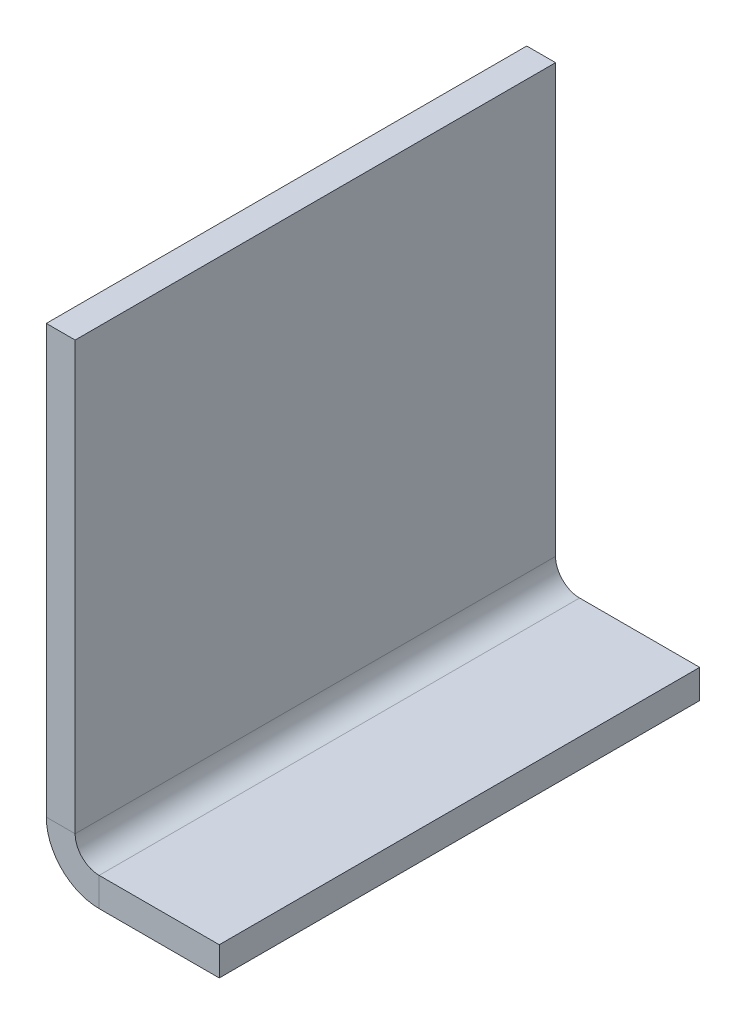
ISO-10303-21;
HEADER;
FILE_DESCRIPTION(('STEP AP214'),'2;1');
FILE_NAME('part.step','',(''),(''),'','','');
FILE_SCHEMA(('AUTOMOTIVE_DESIGN { 1 0 10303 214 1 1 1 1 }'));
ENDSEC;
DATA;
#1=APPLICATION_CONTEXT('core data for automotive mechanical design processes');
#2=APPLICATION_PROTOCOL_DEFINITION('international standard','automotive_design',2000,#1);
#3=PRODUCT_CONTEXT('',#1,'mechanical');
#4=PRODUCT('Part','Part','',(#3));
#5=PRODUCT_RELATED_PRODUCT_CATEGORY('part','',(#4));
#6=PRODUCT_DEFINITION_FORMATION('','',#4);
#7=PRODUCT_DEFINITION_CONTEXT('part definition',#1,'design');
#8=PRODUCT_DEFINITION('design','',#6,#7);
#9=PRODUCT_DEFINITION_SHAPE('','',#8);
#10=(LENGTH_UNIT() NAMED_UNIT(*) SI_UNIT(.MILLI.,.METRE.));
#11=(NAMED_UNIT(*) PLANE_ANGLE_UNIT() SI_UNIT($,.RADIAN.));
#12=(NAMED_UNIT(*) SI_UNIT($,.STERADIAN.) SOLID_ANGLE_UNIT());
#13=UNCERTAINTY_MEASURE_WITH_UNIT(LENGTH_MEASURE(1.E-05),#10,'distance_accuracy_value','');
#14=(GEOMETRIC_REPRESENTATION_CONTEXT(3) GLOBAL_UNCERTAINTY_ASSIGNED_CONTEXT((#13)) GLOBAL_UNIT_ASSIGNED_CONTEXT((#10,
#11,#12)) REPRESENTATION_CONTEXT('',''));
#15=CARTESIAN_POINT('',(0.,0.,0.));
#16=DIRECTION('',(0.,0.,1.));
#17=DIRECTION('',(1.,0.,0.));
#18=AXIS2_PLACEMENT_3D('',#15,#16,#17);
#19=CARTESIAN_POINT('',(0.,11.,50.));
#20=DIRECTION('',(0.,0.,1.));
#21=DIRECTION('',(1.,0.,0.));
#22=AXIS2_PLACEMENT_3D('',#19,#20,#21);
#23=PLANE('',#22);
#24=DIRECTION('',(1.,0.,0.));
#25=VECTOR('',#24,1.);
#26=CARTESIAN_POINT('',(0.,11.,50.));
#27=LINE('',#26,#25);
#28=CARTESIAN_POINT('',(0.,11.,50.));
#29=VERTEX_POINT('',#28);
#30=CARTESIAN_POINT('',(6.,11.,50.));
#31=VERTEX_POINT('',#30);
#32=EDGE_CURVE('E11',#29,#31,#27,.T.);
#33=ORIENTED_EDGE('',*,*,#32,.F.);
#34=CARTESIAN_POINT('',(11.,11.,50.));
#35=DIRECTION('',(0.,0.,1.));
#36=DIRECTION('',(1.,0.,0.));
#37=AXIS2_PLACEMENT_3D('',#34,#35,#36);
#38=CIRCLE('',#37,11.);
#39=CARTESIAN_POINT('',(11.,0.,50.));
#40=VERTEX_POINT('',#39);
#41=EDGE_CURVE('E136',#40,#29,#38,.F.);
#42=ORIENTED_EDGE('',*,*,#41,.F.);
#43=DIRECTION('',(0.,-1.,0.));
#44=VECTOR('',#43,1.);
#45=CARTESIAN_POINT('',(11.,6.,50.));
#46=LINE('',#45,#44);
#47=CARTESIAN_POINT('',(11.,6.,50.));
#48=VERTEX_POINT('',#47);
#49=EDGE_CURVE('E47',#48,#40,#46,.T.);
#50=ORIENTED_EDGE('',*,*,#49,.F.);
#51=CARTESIAN_POINT('',(11.,11.,50.));
#52=DIRECTION('',(0.,0.,1.));
#53=DIRECTION('',(1.,0.,0.));
#54=AXIS2_PLACEMENT_3D('',#51,#52,#53);
#55=CIRCLE('',#54,5.);
#56=EDGE_CURVE('E129',#48,#31,#55,.F.);
#57=ORIENTED_EDGE('',*,*,#56,.T.);
#58=EDGE_LOOP('',(#33,#42,#50,#57));
#59=FACE_BOUND('',#58,.T.);
#60=ADVANCED_FACE('F39',(#59),#23,.T.);
#61=CARTESIAN_POINT('',(11.,6.,50.));
#62=DIRECTION('',(0.,0.,1.));
#63=DIRECTION('',(1.,0.,0.));
#64=AXIS2_PLACEMENT_3D('',#61,#62,#63);
#65=PLANE('',#64);
#66=DIRECTION('',(0.,1.,0.));
#67=VECTOR('',#66,1.);
#68=CARTESIAN_POINT('',(0.,0.,50.));
#69=LINE('',#68,#67);
#70=CARTESIAN_POINT('',(0.,100.,50.));
#71=VERTEX_POINT('',#70);
#72=EDGE_CURVE('E185',#29,#71,#69,.T.);
#73=ORIENTED_EDGE('',*,*,#72,.F.);
#74=ORIENTED_EDGE('',*,*,#32,.T.);
#75=DIRECTION('',(0.,1.,0.));
#76=VECTOR('',#75,1.);
#77=CARTESIAN_POINT('',(6.,0.,50.));
#78=LINE('',#77,#76);
#79=CARTESIAN_POINT('',(6.,100.,50.));
#80=VERTEX_POINT('',#79);
#81=EDGE_CURVE('E95',#31,#80,#78,.T.);
#82=ORIENTED_EDGE('',*,*,#81,.T.);
#83=DIRECTION('',(1.,0.,0.));
#84=VECTOR('',#83,1.);
#85=CARTESIAN_POINT('',(0.,100.,50.));
#86=LINE('',#85,#84);
#87=EDGE_CURVE('E342',#71,#80,#86,.T.);
#88=ORIENTED_EDGE('',*,*,#87,.F.);
#89=EDGE_LOOP('',(#73,#74,#82,#88));
#90=FACE_BOUND('',#89,.T.);
#91=ADVANCED_FACE('F193',(#90),#65,.T.);
#92=CARTESIAN_POINT('',(11.,0.,-50.));
#93=DIRECTION('',(0.,0.,-1.));
#94=DIRECTION('',(-1.,0.,0.));
#95=AXIS2_PLACEMENT_3D('',#92,#93,#94);
#96=PLANE('',#95);
#97=DIRECTION('',(0.,1.,0.));
#98=VECTOR('',#97,1.);
#99=CARTESIAN_POINT('',(11.,0.,-50.));
#100=LINE('',#99,#98);
#101=CARTESIAN_POINT('',(11.,0.,-50.));
#102=VERTEX_POINT('',#101);
#103=CARTESIAN_POINT('',(11.,6.,-50.));
#104=VERTEX_POINT('',#103);
#105=EDGE_CURVE('E82',#102,#104,#100,.T.);
#106=ORIENTED_EDGE('',*,*,#105,.F.);
#107=CARTESIAN_POINT('',(11.,11.,-50.));
#108=DIRECTION('',(0.,0.,1.));
#109=DIRECTION('',(1.,0.,0.));
#110=AXIS2_PLACEMENT_3D('',#107,#108,#109);
#111=CIRCLE('',#110,11.);
#112=CARTESIAN_POINT('',(0.,11.,-50.));
#113=VERTEX_POINT('',#112);
#114=EDGE_CURVE('E151',#102,#113,#111,.F.);
#115=ORIENTED_EDGE('',*,*,#114,.T.);
#116=DIRECTION('',(-1.,0.,0.));
#117=VECTOR('',#116,1.);
#118=CARTESIAN_POINT('',(6.,11.,-50.));
#119=LINE('',#118,#117);
#120=CARTESIAN_POINT('',(6.,11.,-50.));
#121=VERTEX_POINT('',#120);
#122=EDGE_CURVE('E89',#121,#113,#119,.T.);
#123=ORIENTED_EDGE('',*,*,#122,.F.);
#124=CARTESIAN_POINT('',(11.,11.,-50.));
#125=DIRECTION('',(0.,0.,1.));
#126=DIRECTION('',(1.,0.,0.));
#127=AXIS2_PLACEMENT_3D('',#124,#125,#126);
#128=CIRCLE('',#127,5.);
#129=EDGE_CURVE('E158',#104,#121,#128,.F.);
#130=ORIENTED_EDGE('',*,*,#129,.F.);
#131=EDGE_LOOP('',(#106,#115,#123,#130));
#132=FACE_BOUND('',#131,.T.);
#133=ADVANCED_FACE('F191',(#132),#96,.T.);
#134=CARTESIAN_POINT('',(6.,11.,-50.));
#135=DIRECTION('',(0.,0.,-1.));
#136=DIRECTION('',(-1.,0.,0.));
#137=AXIS2_PLACEMENT_3D('',#134,#135,#136);
#138=PLANE('',#137);
#139=DIRECTION('',(-1.,0.,0.));
#140=VECTOR('',#139,1.);
#141=CARTESIAN_POINT('',(36.,0.,-50.));
#142=LINE('',#141,#140);
#143=CARTESIAN_POINT('',(36.,0.,-50.));
#144=VERTEX_POINT('',#143);
#145=EDGE_CURVE('E153',#144,#102,#142,.T.);
#146=ORIENTED_EDGE('',*,*,#145,.T.);
#147=ORIENTED_EDGE('',*,*,#105,.T.);
#148=DIRECTION('',(-1.,0.,0.));
#149=VECTOR('',#148,1.);
#150=CARTESIAN_POINT('',(36.,6.,-50.));
#151=LINE('',#150,#149);
#152=CARTESIAN_POINT('',(36.,6.,-50.));
#153=VERTEX_POINT('',#152);
#154=EDGE_CURVE('E156',#153,#104,#151,.T.);
#155=ORIENTED_EDGE('',*,*,#154,.F.);
#156=DIRECTION('',(0.,-1.,0.));
#157=VECTOR('',#156,1.);
#158=CARTESIAN_POINT('',(36.,6.,-50.));
#159=LINE('',#158,#157);
#160=EDGE_CURVE('E117',#153,#144,#159,.T.);
#161=ORIENTED_EDGE('',*,*,#160,.T.);
#162=EDGE_LOOP('',(#146,#147,#155,#161));
#163=FACE_BOUND('',#162,.T.);
#164=ADVANCED_FACE('F187',(#163),#138,.T.);
#165=CARTESIAN_POINT('',(6.,0.,50.));
#166=DIRECTION('',(-1.,0.,0.));
#167=DIRECTION('',(0.,0.,1.));
#168=AXIS2_PLACEMENT_3D('',#165,#166,#167);
#169=PLANE('',#168);
#170=DIRECTION('',(0.,1.,0.));
#171=VECTOR('',#170,1.);
#172=CARTESIAN_POINT('',(6.,0.,-50.));
#173=LINE('',#172,#171);
#174=CARTESIAN_POINT('',(6.,100.,-50.));
#175=VERTEX_POINT('',#174);
#176=EDGE_CURVE('E142',#121,#175,#173,.T.);
#177=ORIENTED_EDGE('',*,*,#176,.T.);
#178=DIRECTION('',(0.,0.,-1.));
#179=VECTOR('',#178,1.);
#180=CARTESIAN_POINT('',(6.,100.,50.));
#181=LINE('',#180,#179);
#182=EDGE_CURVE('E172',#80,#175,#181,.T.);
#183=ORIENTED_EDGE('',*,*,#182,.F.);
#184=ORIENTED_EDGE('',*,*,#81,.F.);
#185=DIRECTION('',(0.,0.,-1.));
#186=VECTOR('',#185,1.);
#187=CARTESIAN_POINT('',(6.,11.,50.));
#188=LINE('',#187,#186);
#189=EDGE_CURVE('E141',#31,#121,#188,.T.);
#190=ORIENTED_EDGE('',*,*,#189,.T.);
#191=EDGE_LOOP('',(#177,#183,#184,#190));
#192=FACE_BOUND('',#191,.T.);
#193=ADVANCED_FACE('F199',(#192),#169,.F.);
#194=CARTESIAN_POINT('',(0.,100.,50.));
#195=DIRECTION('',(0.,1.,0.));
#196=DIRECTION('',(0.,0.,1.));
#197=AXIS2_PLACEMENT_3D('',#194,#195,#196);
#198=PLANE('',#197);
#199=DIRECTION('',(1.,0.,0.));
#200=VECTOR('',#199,1.);
#201=CARTESIAN_POINT('',(0.,100.,-50.));
#202=LINE('',#201,#200);
#203=CARTESIAN_POINT('',(0.,100.,-50.));
#204=VERTEX_POINT('',#203);
#205=EDGE_CURVE('E145',#204,#175,#202,.T.);
#206=ORIENTED_EDGE('',*,*,#205,.F.);
#207=DIRECTION('',(0.,0.,-1.));
#208=VECTOR('',#207,1.);
#209=CARTESIAN_POINT('',(0.,100.,50.));
#210=LINE('',#209,#208);
#211=EDGE_CURVE('E170',#71,#204,#210,.T.);
#212=ORIENTED_EDGE('',*,*,#211,.F.);
#213=ORIENTED_EDGE('',*,*,#87,.T.);
#214=ORIENTED_EDGE('',*,*,#182,.T.);
#215=EDGE_LOOP('',(#206,#212,#213,#214));
#216=FACE_BOUND('',#215,.T.);
#217=ADVANCED_FACE('F230',(#216),#198,.T.);
#218=CARTESIAN_POINT('',(0.,0.,50.));
#219=DIRECTION('',(-1.,0.,0.));
#220=DIRECTION('',(0.,0.,1.));
#221=AXIS2_PLACEMENT_3D('',#218,#219,#220);
#222=PLANE('',#221);
#223=DIRECTION('',(0.,1.,0.));
#224=VECTOR('',#223,1.);
#225=CARTESIAN_POINT('',(0.,0.,-50.));
#226=LINE('',#225,#224);
#227=EDGE_CURVE('E148',#113,#204,#226,.T.);
#228=ORIENTED_EDGE('',*,*,#227,.F.);
#229=DIRECTION('',(0.,0.,-1.));
#230=VECTOR('',#229,1.);
#231=CARTESIAN_POINT('',(0.,11.,50.));
#232=LINE('',#231,#230);
#233=EDGE_CURVE('E167',#29,#113,#232,.T.);
#234=ORIENTED_EDGE('',*,*,#233,.F.);
#235=ORIENTED_EDGE('',*,*,#72,.T.);
#236=ORIENTED_EDGE('',*,*,#211,.T.);
#237=EDGE_LOOP('',(#228,#234,#235,#236));
#238=FACE_BOUND('',#237,.T.);
#239=ADVANCED_FACE('F241',(#238),#222,.T.);
#240=CARTESIAN_POINT('',(11.,11.,50.));
#241=DIRECTION('',(0.,0.,-1.));
#242=DIRECTION('',(-1.,0.,0.));
#243=AXIS2_PLACEMENT_3D('',#240,#241,#242);
#244=CYLINDRICAL_SURFACE('',#243,11.);
#245=ORIENTED_EDGE('',*,*,#114,.F.);
#246=DIRECTION('',(0.,0.,-1.));
#247=VECTOR('',#246,1.);
#248=CARTESIAN_POINT('',(11.,0.,50.));
#249=LINE('',#248,#247);
#250=EDGE_CURVE('E164',#40,#102,#249,.T.);
#251=ORIENTED_EDGE('',*,*,#250,.F.);
#252=ORIENTED_EDGE('',*,*,#41,.T.);
#253=ORIENTED_EDGE('',*,*,#233,.T.);
#254=EDGE_LOOP('',(#245,#251,#252,#253));
#255=FACE_BOUND('',#254,.T.);
#256=ADVANCED_FACE('F181',(#255),#244,.T.);
#257=CARTESIAN_POINT('',(36.,0.,50.));
#258=DIRECTION('',(0.,-1.,0.));
#259=DIRECTION('',(1.,0.,0.));
#260=AXIS2_PLACEMENT_3D('',#257,#258,#259);
#261=PLANE('',#260);
#262=ORIENTED_EDGE('',*,*,#145,.F.);
#263=DIRECTION('',(0.,0.,-1.));
#264=VECTOR('',#263,1.);
#265=CARTESIAN_POINT('',(36.,0.,50.));
#266=LINE('',#265,#264);
#267=CARTESIAN_POINT('',(36.,0.,50.));
#268=VERTEX_POINT('',#267);
#269=EDGE_CURVE('E119',#268,#144,#266,.T.);
#270=ORIENTED_EDGE('',*,*,#269,.F.);
#271=DIRECTION('',(-1.,0.,0.));
#272=VECTOR('',#271,1.);
#273=CARTESIAN_POINT('',(36.,0.,50.));
#274=LINE('',#273,#272);
#275=EDGE_CURVE('E134',#268,#40,#274,.T.);
#276=ORIENTED_EDGE('',*,*,#275,.T.);
#277=ORIENTED_EDGE('',*,*,#250,.T.);
#278=EDGE_LOOP('',(#262,#270,#276,#277));
#279=FACE_BOUND('',#278,.T.);
#280=ADVANCED_FACE('F186',(#279),#261,.T.);
#281=CARTESIAN_POINT('',(36.,6.,50.));
#282=DIRECTION('',(1.,0.,0.));
#283=DIRECTION('',(0.,0.,-1.));
#284=AXIS2_PLACEMENT_3D('',#281,#282,#283);
#285=PLANE('',#284);
#286=ORIENTED_EDGE('',*,*,#160,.F.);
#287=DIRECTION('',(0.,0.,-1.));
#288=VECTOR('',#287,1.);
#289=CARTESIAN_POINT('',(36.,6.,50.));
#290=LINE('',#289,#288);
#291=CARTESIAN_POINT('',(36.,6.,50.));
#292=VERTEX_POINT('',#291);
#293=EDGE_CURVE('E111',#292,#153,#290,.T.);
#294=ORIENTED_EDGE('',*,*,#293,.F.);
#295=DIRECTION('',(0.,-1.,0.));
#296=VECTOR('',#295,1.);
#297=CARTESIAN_POINT('',(36.,6.,50.));
#298=LINE('',#297,#296);
#299=EDGE_CURVE('E115',#292,#268,#298,.T.);
#300=ORIENTED_EDGE('',*,*,#299,.T.);
#301=ORIENTED_EDGE('',*,*,#269,.T.);
#302=EDGE_LOOP('',(#286,#294,#300,#301));
#303=FACE_BOUND('',#302,.T.);
#304=ADVANCED_FACE('F113',(#303),#285,.T.);
#305=CARTESIAN_POINT('',(36.,6.,50.));
#306=DIRECTION('',(0.,-1.,0.));
#307=DIRECTION('',(1.,0.,0.));
#308=AXIS2_PLACEMENT_3D('',#305,#306,#307);
#309=PLANE('',#308);
#310=ORIENTED_EDGE('',*,*,#154,.T.);
#311=DIRECTION('',(0.,0.,-1.));
#312=VECTOR('',#311,1.);
#313=CARTESIAN_POINT('',(11.,6.,50.));
#314=LINE('',#313,#312);
#315=EDGE_CURVE('E120',#48,#104,#314,.T.);
#316=ORIENTED_EDGE('',*,*,#315,.F.);
#317=DIRECTION('',(-1.,0.,0.));
#318=VECTOR('',#317,1.);
#319=CARTESIAN_POINT('',(36.,6.,50.));
#320=LINE('',#319,#318);
#321=EDGE_CURVE('E124',#292,#48,#320,.T.);
#322=ORIENTED_EDGE('',*,*,#321,.F.);
#323=ORIENTED_EDGE('',*,*,#293,.T.);
#324=EDGE_LOOP('',(#310,#316,#322,#323));
#325=FACE_BOUND('',#324,.T.);
#326=ADVANCED_FACE('F125',(#325),#309,.F.);
#327=CARTESIAN_POINT('',(11.,11.,50.));
#328=DIRECTION('',(0.,0.,-1.));
#329=DIRECTION('',(-1.,0.,0.));
#330=AXIS2_PLACEMENT_3D('',#327,#328,#329);
#331=CYLINDRICAL_SURFACE('',#330,5.);
#332=ORIENTED_EDGE('',*,*,#129,.T.);
#333=ORIENTED_EDGE('',*,*,#189,.F.);
#334=ORIENTED_EDGE('',*,*,#56,.F.);
#335=ORIENTED_EDGE('',*,*,#315,.T.);
#336=EDGE_LOOP('',(#332,#333,#334,#335));
#337=FACE_BOUND('',#336,.T.);
#338=ADVANCED_FACE('F189',(#337),#331,.F.);
#339=CARTESIAN_POINT('',(11.,11.,50.));
#340=DIRECTION('',(0.,0.,1.));
#341=DIRECTION('',(1.,0.,0.));
#342=AXIS2_PLACEMENT_3D('',#339,#340,#341);
#343=PLANE('',#342);
#344=ORIENTED_EDGE('',*,*,#321,.T.);
#345=ORIENTED_EDGE('',*,*,#49,.T.);
#346=ORIENTED_EDGE('',*,*,#275,.F.);
#347=ORIENTED_EDGE('',*,*,#299,.F.);
#348=EDGE_LOOP('',(#344,#345,#346,#347));
#349=FACE_BOUND('',#348,.T.);
#350=ADVANCED_FACE('F132',(#349),#343,.T.);
#351=CARTESIAN_POINT('',(11.,11.,-50.));
#352=DIRECTION('',(0.,0.,1.));
#353=DIRECTION('',(1.,0.,0.));
#354=AXIS2_PLACEMENT_3D('',#351,#352,#353);
#355=PLANE('',#354);
#356=ORIENTED_EDGE('',*,*,#176,.F.);
#357=ORIENTED_EDGE('',*,*,#122,.T.);
#358=ORIENTED_EDGE('',*,*,#227,.T.);
#359=ORIENTED_EDGE('',*,*,#205,.T.);
#360=EDGE_LOOP('',(#356,#357,#358,#359));
#361=FACE_BOUND('',#360,.T.);
#362=ADVANCED_FACE('F307',(#361),#355,.F.);
#363=CLOSED_SHELL('',(#60,#91,#133,#164,#193,#217,#239,#256,#280,#304,#326,#338,#350,#362));
#364=MANIFOLD_SOLID_BREP('B2',#363);
#365=ADVANCED_BREP_SHAPE_REPRESENTATION('',(#18,#364),#14);
#366=SHAPE_DEFINITION_REPRESENTATION(#9,#365);
ENDSEC;
END-ISO-10303-21;
